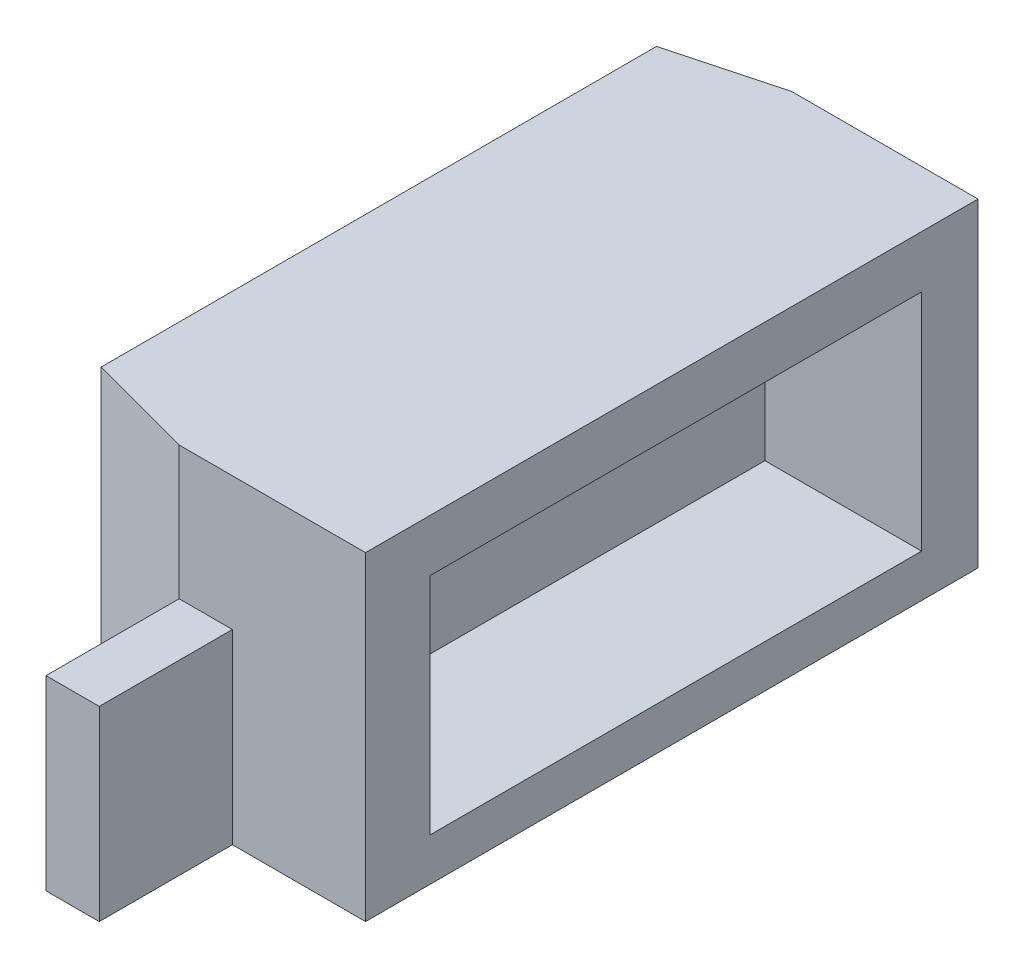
from build123d import *
from OCP.BRepFilletAPI import BRepFilletAPI_MakeChamfer

# Parameters (mm, degrees)
SKETCH1_W           = 1.1
SKETCH1_H           = 2.3
BOSS_EXTRUDE1_DEPTH = 1.2
SKETCH2_W           = 0.2
SKETCH2_H           = 0.5
BOSS_EXTRUDE2_DEPTH = 0.7
SKETCH3_W           = 1.846124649
SKETCH3_H           = 0.843229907
CUT_EXTRUDE1_DEPTH  = 0.5
DRAFT1_ANGLE        = 10
CHAMFER1_SIZE       = 0.4
CHAMFER1_SIZE2      = 0.107179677


with BuildPart() as part:
    # Sketch1 → Boss-Extrude1 (new body)
    with BuildSketch(Plane(origin=(0, 0, 0), x_dir=(1, 0, 0), z_dir=(0, 1, 0))):
        Rectangle(SKETCH1_W, SKETCH1_H)
    extrude(amount=BOSS_EXTRUDE1_DEPTH)

    # Sketch2 → Boss-Extrude2 (add)
    with BuildSketch(Plane.XZ):
        with Locations((-0.05, 1.4)):
            Rectangle(SKETCH2_W, SKETCH2_H)
        with Locations((-0.05, -1.4)):
            Rectangle(SKETCH2_W, SKETCH2_H)
    extrude(amount=-BOSS_EXTRUDE2_DEPTH)

    # Sketch3 → Cut-Extrude1 (cut)
    with BuildSketch(Plane(origin=(0.55, 0, 0), x_dir=(0, 0, -1), z_dir=(1, 0, 0))):
        with Locations((0.014968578, 0.582511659)):
            Rectangle(SKETCH3_W, SKETCH3_H)
    extrude(amount=-CUT_EXTRUDE1_DEPTH, mode=Mode.SUBTRACT)

    # Draft1
    draft1_faces = [part.faces().sort_by_distance(p)[0] for p in [
        (0.3, 0.160896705, -0.014968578),
        (0.3, 0.582511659, 0.908093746),
        (0.3, 1.004126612, -0.014968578),
        (0.3, 0.582511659, -0.938030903),
    ]]
    draft(draft1_faces, Plane(origin=(0.55, 1.2, 1.15), x_dir=(0, 0, 1), z_dir=(1, 0, 0)), DRAFT1_ANGLE)

    # Chamfer1: one chamfer whose edges measure the first distance from different faces: ONE call of the kernel's chamfer builder (chamfer() names one face for all edges)
    chamfer1_edges_1 = [part.edges().sort_by_distance(p)[0] for p in [
        (-0.55, 0.6, 1.15),
    ]]
    chamfer1_side_1 = [part.faces().sort_by_distance(p)[0] for p in [
        (-0.35, 0.016278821, 1.15),
    ]]
    chamfer1_edges_2 = [part.edges().sort_by_distance(p)[0] for p in [
        (-0.55, 0.6, -1.15),
    ]]
    chamfer1_side_2 = [part.faces().sort_by_distance(p)[0] for p in [
        (0.3, 0.016278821, -1.15),
    ]]
    chamfer1 = BRepFilletAPI_MakeChamfer(part.part.solid().wrapped)
    for e in chamfer1_edges_1:
        chamfer1.Add(CHAMFER1_SIZE, CHAMFER1_SIZE2, e.wrapped, chamfer1_side_1[0].wrapped)  # the first distance lies on this face
    for e in chamfer1_edges_2:
        chamfer1.Add(CHAMFER1_SIZE, CHAMFER1_SIZE2, e.wrapped, chamfer1_side_2[0].wrapped)  # the first distance lies on this face
    add(Compound.cast(chamfer1.Shape()), mode=Mode.REPLACE)


solid = part.part
